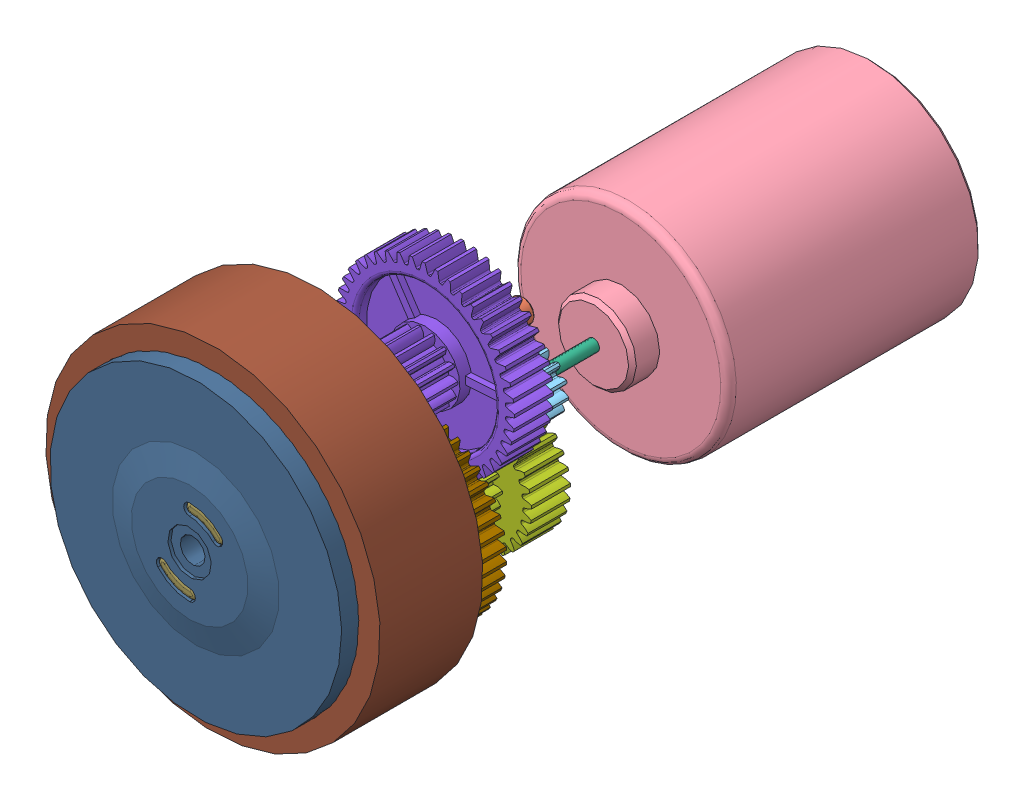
SolidWorks assembly motorisation.SLDASM, configuration Défaut (file format 5000). Lengths in mm.
Overall size (60.36 60.36 84.4).
15 component instances, 12 part files, 14 mates.
Components (placement in the parent):
- bati_motoreducteur-1: bati_motoreducteur.SLDASM [Défaut] at origin size (39.16 39.16 75.9)
  - axe_1-1: axe_1.SLDPRT [Défaut] at origin size (3 3 32.4)
  - axe_2-1: axe_2.SLDPRT [Défaut] at (0 15 0) size (3 3 20.7)
  - axe_couronne-1: axe_couronne.SLDPRT [Défaut] at (-2.5529 6.8924 19.4) x (0.973251 -0.229746 0) z (0 0 1) size (3 3 9)
  - stator_moteur-1: stator_moteur.SLDPRT [Défaut] at (3.7712 10.3333 -41.3) x (0.687988 -0.725722 0) z (0 0 1) size (27.7 27.7 38.3)
- arbre_moteur-1: arbre_moteur.SLDASM [Défaut] at (3.7712 10.3333 1.7) x (0.992095 0.125487 0) z (0 0 1) size (7.86 8 51)
  - pignon_moteur-1: pignon_moteur.SLDPRT [Défaut] at origin size (7.86 8 5.3)
  - axe_moteur-1: axe_moteur.SLDPRT [Défaut] at (0 0 -45.7) x (0.966368 0.257162 0) z (0 0 1) size (1.5 1.5 51)
- arbre_intermediaire_1-1: arbre_intermediaire_1.SLDPRT [Défaut] at (0 0 8) x (-0.055797 0.998442 0) z (0 0 -1) size (15.95 16 11.3)
- arbre_intermediaire_2-1: arbre_intermediaire_2.SLDPRT [Défaut] at (0 15 6.7) x (0.832149 0.554552 0) z (0 0 1) size (23 23 11.6)
- arbre_intermediaire_3-1: arbre_intermediaire_3.SLDPRT [Défaut] at (0 0 13.6) x (0.716847 -0.697231 0) z (0 0 1) size (23 23 17.2)
- roue-1: roue.SLDASM [Défaut] at (-2.5529 6.8924 23.2) x (0 0 1) z (0.914007 -0.405699 0) size (17.2 45.74 45.74)
  - jante-1: jante.SLDPRT [Défaut] at origin size (17.2 39.5 39.5)
  - pneu-1: pneu.SLDPRT [Défaut] at (14.2 0 0) x (0 -0.065809 0.997832) z (-1 0 0) size (43 43 13.2)
  - couronne-1: couronne.SLDPRT [Défaut] at (13.05 0 0) x (0 0 1) z (-1 0 0) size (26.6 26.6 16.65)
Mates (geometry in assembly coordinates):
- Coïncidente15: coincident aligned: axis of bati_motoreducteur-1/stator_moteur-1 through (3.7712 10.3333 -9.7) axis (0 0 -1); axis of arbre_moteur-1/axe_moteur-1 through (3.7712 10.3333 6.8) axis (0 0 -1)
- Distance4: distance = 44 mm aligned: plane of bati_motoreducteur-1/axe_1-1 through (0 0 0) normal (0 0 -1); plane of arbre_moteur-1/axe_moteur-1 through (3.7712 10.3333 -44) normal (0 0 -1)
- Coïncidente5: coincident anti-aligned: axis of bati_motoreducteur-1/axe_1-1 through (0 0 32.2) axis (0 0 -1); axis of arbre_intermediaire_1-1 through (0 0 2) axis (0 0 1)
- Distance5: distance = 2 mm aligned: plane of bati_motoreducteur-1/axe_1-1 through (0 0 0) normal (0 0 -1); plane of arbre_intermediaire_1-1 through (0 0 2) normal (0 0 -1)
- Contr.Engrenages2: gear = 30000 mm: axis of arbre_moteur-1/axe_moteur-1 through (3.7712 10.3333 6.8) axis (0 0 -1); axis of arbre_intermediaire_1-1 through (0 0 13) axis (0 0 -1)
- Coïncidente9: coincident aligned: axis of bati_motoreducteur-1/axe_2-1 through (0 15 20.5) axis (0 0 -1); axis of arbre_intermediaire_2-1 through (0 15 18.7) axis (0 0 -1)
- Distance7: distance = 8 mm aligned: plane of bati_motoreducteur-1/axe_2-1 through (0 15 20.7) normal (0 0 1); plane of arbre_intermediaire_2-1 through (0 15 12.7) normal (0 0 1)
- Contr.Engrenages3: gear = 15000 mm: axis of arbre_intermediaire_2-1 through (0 15 9.2) axis (0 0 -1); axis of arbre_intermediaire_1-1 through (0 0 2) axis (0 0 1)
- Coïncidente13: coincident aligned: axis of bati_motoreducteur-1/axe_1-1 through (0 0 32.2) axis (0 0 -1); axis of arbre_intermediaire_3-1 through (0 0 29.7) axis (0 0 -1)
- Distance8: distance = 18.7 mm anti-aligned: plane of bati_motoreducteur-1/axe_1-1 through (0 0 0) normal (0 0 -1); plane of arbre_intermediaire_3-1 through (0 0 18.7) normal (0 0 1)
- Contr.Engrenages4: gear = 44000 mm: axis of arbre_intermediaire_2-1 through (0 15 9.2) axis (0 0 -1); axis of arbre_intermediaire_3-1 through (0 0 29.7) axis (0 0 -1)
- Coïncidente14: coincident anti-aligned: axis of bati_motoreducteur-1/axe_couronne-1 through (-2.5529 6.8924 28.2) axis (0 0 -1); axis of roue-1/couronne-1 through (-2.5529 6.8924 23.65) axis (0 0 1)
- Distance9: distance = 4.5 mm anti-aligned: plane of bati_motoreducteur-1/axe_couronne-1 through (-2.5529 6.8924 28.4) normal (0 0 1); plane of roue-1/couronne-1 through (-2.5529 6.8924 23.9) normal (0 0 -1)
- Contr.Engrenages5: gear = 31000 mm: axis of arbre_intermediaire_3-1 through (0 0 29.7) axis (0 0 -1); axis of roue-1/couronne-1 through (-2.5529 6.8924 23.65) axis (0 0 1)
